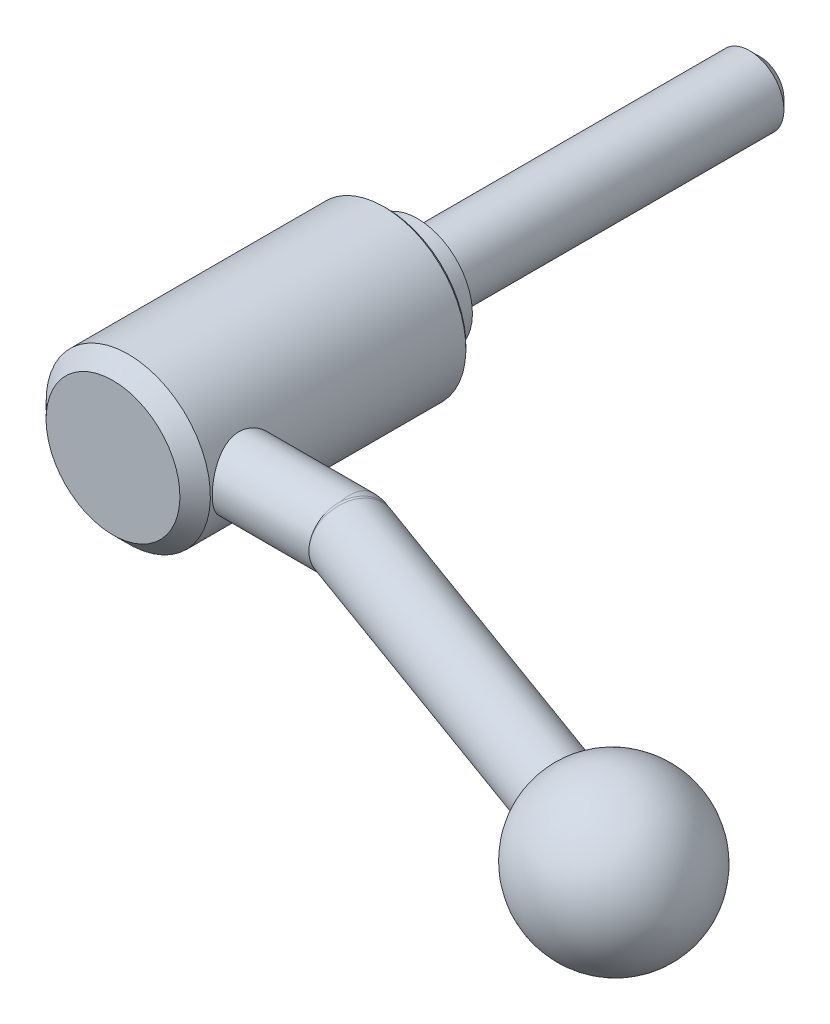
ISO-10303-21;
HEADER;
FILE_DESCRIPTION(('STEP AP214'),'2;1');
FILE_NAME('part.step','',(''),(''),'','','');
FILE_SCHEMA(('AUTOMOTIVE_DESIGN { 1 0 10303 214 1 1 1 1 }'));
ENDSEC;
DATA;
#1=APPLICATION_CONTEXT('core data for automotive mechanical design processes');
#2=APPLICATION_PROTOCOL_DEFINITION('international standard','automotive_design',2000,#1);
#3=PRODUCT_CONTEXT('',#1,'mechanical');
#4=PRODUCT('Part','Part','',(#3));
#5=PRODUCT_RELATED_PRODUCT_CATEGORY('part','',(#4));
#6=PRODUCT_DEFINITION_FORMATION('','',#4);
#7=PRODUCT_DEFINITION_CONTEXT('part definition',#1,'design');
#8=PRODUCT_DEFINITION('design','',#6,#7);
#9=PRODUCT_DEFINITION_SHAPE('','',#8);
#10=(LENGTH_UNIT() NAMED_UNIT(*) SI_UNIT(.MILLI.,.METRE.));
#11=(NAMED_UNIT(*) PLANE_ANGLE_UNIT() SI_UNIT($,.RADIAN.));
#12=(NAMED_UNIT(*) SI_UNIT($,.STERADIAN.) SOLID_ANGLE_UNIT());
#13=UNCERTAINTY_MEASURE_WITH_UNIT(LENGTH_MEASURE(1.E-05),#10,'distance_accuracy_value','');
#14=(GEOMETRIC_REPRESENTATION_CONTEXT(3) GLOBAL_UNCERTAINTY_ASSIGNED_CONTEXT((#13)) GLOBAL_UNIT_ASSIGNED_CONTEXT((#10,
#11,#12)) REPRESENTATION_CONTEXT('',''));
#15=CARTESIAN_POINT('',(0.,0.,0.));
#16=DIRECTION('',(0.,0.,1.));
#17=DIRECTION('',(1.,0.,0.));
#18=AXIS2_PLACEMENT_3D('',#15,#16,#17);
#19=CARTESIAN_POINT('',(0.,0.,0.));
#20=DIRECTION('',(0.,0.,-1.));
#21=DIRECTION('',(0.,1.,0.));
#22=AXIS2_PLACEMENT_3D('',#19,#20,#21);
#23=CYLINDRICAL_SURFACE('',#22,12.);
#24=CARTESIAN_POINT('',(0.,0.,4.95));
#25=DIRECTION('',(0.,0.,-1.));
#26=DIRECTION('',(0.,1.,0.));
#27=AXIS2_PLACEMENT_3D('',#24,#25,#26);
#28=CIRCLE('',#27,12.);
#29=CARTESIAN_POINT('',(0.,12.,4.95));
#30=VERTEX_POINT('',#29);
#31=EDGE_CURVE('E147',#30,#30,#28,.T.);
#32=ORIENTED_EDGE('',*,*,#31,.F.);
#33=EDGE_LOOP('',(#32));
#34=FACE_BOUND('',#33,.T.);
#35=CARTESIAN_POINT('',(10.9087121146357,5.,37.));
#36=CARTESIAN_POINT('',(10.9087130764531,4.99999907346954,37.1334013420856));
#37=CARTESIAN_POINT('',(10.9111675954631,4.99465346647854,37.266850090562));
#38=CARTESIAN_POINT('',(10.9209052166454,4.97332510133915,37.5327768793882));
#39=CARTESIAN_POINT('',(10.9281914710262,4.95733539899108,37.6652542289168));
#40=CARTESIAN_POINT('',(10.94736464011,4.91485001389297,37.928469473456));
#41=CARTESIAN_POINT('',(10.9592613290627,4.88833200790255,38.0592030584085));
#42=CARTESIAN_POINT('',(10.9872633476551,4.82506361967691,38.3177583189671));
#43=CARTESIAN_POINT('',(11.0033704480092,4.7883089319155,38.4455787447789));
#44=CARTESIAN_POINT('',(11.0391992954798,4.7051161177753,38.6968536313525));
#45=CARTESIAN_POINT('',(11.0589043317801,4.65872262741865,38.8203252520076));
#46=CARTESIAN_POINT('',(11.1013893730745,4.5565572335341,39.062794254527));
#47=CARTESIAN_POINT('',(11.1241705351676,4.5007817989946,39.1817899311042));
#48=CARTESIAN_POINT('',(11.1961478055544,4.3200790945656,39.5308988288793));
#49=CARTESIAN_POINT('',(11.2490254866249,4.18166963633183,39.7534507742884));
#50=CARTESIAN_POINT('',(11.3622340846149,3.86388960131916,40.185337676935));
#51=CARTESIAN_POINT('',(11.4228172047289,3.68264836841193,40.3932181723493));
#52=CARTESIAN_POINT('',(11.5425773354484,3.28805127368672,40.7768129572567));
#53=CARTESIAN_POINT('',(11.6017537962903,3.07468308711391,40.9525148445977));
#54=CARTESIAN_POINT('',(11.6861172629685,2.72939811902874,41.1918033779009));
#55=CARTESIAN_POINT('',(11.7140370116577,2.60726265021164,41.2688525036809));
#56=CARTESIAN_POINT('',(11.7670757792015,2.35633907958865,41.4123143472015));
#57=CARTESIAN_POINT('',(11.7921959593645,2.22755376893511,41.4787314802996));
#58=CARTESIAN_POINT('',(11.838917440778,1.96416180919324,41.6003389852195));
#59=CARTESIAN_POINT('',(11.8605184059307,1.82955460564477,41.6555282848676));
#60=CARTESIAN_POINT('',(11.8995529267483,1.55556138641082,41.7540939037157));
#61=CARTESIAN_POINT('',(11.9169885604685,1.41617779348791,41.7974761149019));
#62=CARTESIAN_POINT('',(11.9463943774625,1.14097065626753,41.8700493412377));
#63=CARTESIAN_POINT('',(11.9586002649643,1.00533485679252,41.8998574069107));
#64=CARTESIAN_POINT('',(11.978450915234,0.731783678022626,41.9481078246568));
#65=CARTESIAN_POINT('',(11.9860977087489,0.593869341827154,41.9665552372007));
#66=CARTESIAN_POINT('',(11.9966178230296,0.316820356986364,41.9918906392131));
#67=CARTESIAN_POINT('',(11.9994918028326,0.177685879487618,41.998780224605));
#68=CARTESIAN_POINT('',(12.0003846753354,-0.100685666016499,42.0009233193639));
#69=CARTESIAN_POINT('',(11.9984037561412,-0.239922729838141,41.9961772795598));
#70=CARTESIAN_POINT('',(11.9899136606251,-0.508875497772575,41.9757519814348));
#71=CARTESIAN_POINT('',(11.9836886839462,-0.638652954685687,41.9607587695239));
#72=CARTESIAN_POINT('',(11.9671679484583,-0.896425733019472,41.9207154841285));
#73=CARTESIAN_POINT('',(11.9568708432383,-1.02442045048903,41.8956620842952));
#74=CARTESIAN_POINT('',(11.9324642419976,-1.27768058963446,41.8357474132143));
#75=CARTESIAN_POINT('',(11.9183560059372,-1.40294689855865,41.8008893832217));
#76=CARTESIAN_POINT('',(11.8866740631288,-1.65000960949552,41.7216867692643));
#77=CARTESIAN_POINT('',(11.8690990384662,-1.77180467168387,41.6773385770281));
#78=CARTESIAN_POINT('',(11.8112061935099,-2.1344060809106,41.5291317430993));
#79=CARTESIAN_POINT('',(11.7660875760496,-2.36878813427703,41.4109765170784));
#80=CARTESIAN_POINT('',(11.6674248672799,-2.81488765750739,41.1406025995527));
#81=CARTESIAN_POINT('',(11.6138778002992,-3.02659707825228,40.9883718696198));
#82=CARTESIAN_POINT('',(11.4992708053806,-3.4373466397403,40.6416848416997));
#83=CARTESIAN_POINT('',(11.4379473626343,-3.6344418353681,40.4450085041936));
#84=CARTESIAN_POINT('',(11.317506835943,-3.9937495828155,40.0211105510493));
#85=CARTESIAN_POINT('',(11.2583906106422,-4.15594867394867,39.7938772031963));
#86=CARTESIAN_POINT('',(11.1754830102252,-4.37204843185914,39.4302315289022));
#87=CARTESIAN_POINT('',(11.1484199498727,-4.44042007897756,39.3029580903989));
#88=CARTESIAN_POINT('',(11.0975376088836,-4.5660982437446,39.0424564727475));
#89=CARTESIAN_POINT('',(11.0737170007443,-4.62340929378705,38.9092307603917));
#90=CARTESIAN_POINT('',(11.0301558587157,-4.72639308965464,38.6377673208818));
#91=CARTESIAN_POINT('',(11.010413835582,-4.77207008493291,38.4995314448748));
#92=CARTESIAN_POINT('',(10.9757324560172,-4.85130620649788,38.219039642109));
#93=CARTESIAN_POINT('',(10.9607926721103,-4.88486641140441,38.0767840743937));
#94=CARTESIAN_POINT('',(10.9370969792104,-4.93768074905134,37.7987576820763));
#95=CARTESIAN_POINT('',(10.9280027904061,-4.95772169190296,37.6631648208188));
#96=CARTESIAN_POINT('',(10.9148523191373,-4.9866073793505,37.3905520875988));
#97=CARTESIAN_POINT('',(10.9107956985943,-4.99545287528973,37.2535323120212));
#98=CARTESIAN_POINT('',(10.9078699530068,-5.00183821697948,36.9792139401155));
#99=CARTESIAN_POINT('',(10.9089993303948,-4.9993813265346,36.8419154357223));
#100=CARTESIAN_POINT('',(10.9163998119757,-4.98320111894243,36.5681288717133));
#101=CARTESIAN_POINT('',(10.9226707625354,-4.96947813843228,36.4316407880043));
#102=CARTESIAN_POINT('',(10.939564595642,-4.93217158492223,36.1692842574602));
#103=CARTESIAN_POINT('',(10.9498816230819,-4.90927900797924,36.0432974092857));
#104=CARTESIAN_POINT('',(10.9744912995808,-4.85401305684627,35.7938045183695));
#105=CARTESIAN_POINT('',(10.9887852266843,-4.82163663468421,35.6702992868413));
#106=CARTESIAN_POINT('',(11.0370194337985,-4.71071065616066,35.3047320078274));
#107=CARTESIAN_POINT('',(11.0763259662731,-4.6183356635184,35.0674195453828));
#108=CARTESIAN_POINT('',(11.1668340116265,-4.39509042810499,34.6014982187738));
#109=CARTESIAN_POINT('',(11.2184687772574,-4.26275559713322,34.3736835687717));
#110=CARTESIAN_POINT('',(11.3271978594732,-3.9648148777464,33.9423843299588));
#111=CARTESIAN_POINT('',(11.3842945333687,-3.79919458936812,33.7389103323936));
#112=CARTESIAN_POINT('',(11.5031524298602,-3.42333828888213,33.344771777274));
#113=CARTESIAN_POINT('',(11.5649149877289,-3.21056780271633,33.1564985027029));
#114=CARTESIAN_POINT('',(11.652539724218,-2.86918502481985,32.9026870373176));
#115=CARTESIAN_POINT('',(11.6809270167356,-2.75160882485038,32.8228101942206));
#116=CARTESIAN_POINT('',(11.7352796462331,-2.50969002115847,32.6731475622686));
#117=CARTESIAN_POINT('',(11.761246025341,-2.38535036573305,32.6033574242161));
#118=CARTESIAN_POINT('',(11.8101156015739,-2.13027929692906,32.4742500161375));
#119=CARTESIAN_POINT('',(11.8330091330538,-1.99952940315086,32.4149656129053));
#120=CARTESIAN_POINT('',(11.8749794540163,-1.73293321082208,32.3077113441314));
#121=CARTESIAN_POINT('',(11.8940578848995,-1.59708913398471,32.2597366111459));
#122=CARTESIAN_POINT('',(11.9278439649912,-1.32129951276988,32.1755883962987));
#123=CARTESIAN_POINT('',(11.9425527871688,-1.18135508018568,32.1394117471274));
#124=CARTESIAN_POINT('',(11.9671605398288,-0.89845467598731,32.0792595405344));
#125=CARTESIAN_POINT('',(11.9770598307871,-0.75549893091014,32.0552830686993));
#126=CARTESIAN_POINT('',(11.9912289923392,-0.477883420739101,32.021064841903));
#127=CARTESIAN_POINT('',(11.9958449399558,-0.343344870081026,32.0099778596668));
#128=CARTESIAN_POINT('',(12.0005316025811,-0.073683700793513,31.9987215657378));
#129=CARTESIAN_POINT('',(12.0006007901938,0.0614390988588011,31.9985559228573));
#130=CARTESIAN_POINT('',(11.9961887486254,0.331106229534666,32.0091516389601));
#131=CARTESIAN_POINT('',(11.9917099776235,0.465650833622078,32.0199070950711));
#132=CARTESIAN_POINT('',(11.9783256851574,0.733261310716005,32.0522225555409));
#133=CARTESIAN_POINT('',(11.9694185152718,0.866326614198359,32.0737865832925));
#134=CARTESIAN_POINT('',(11.9478093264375,1.12521434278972,32.1265303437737));
#135=CARTESIAN_POINT('',(11.9352551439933,1.25112522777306,32.1573367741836));
#136=CARTESIAN_POINT('',(11.9065633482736,1.49981842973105,32.2284909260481));
#137=CARTESIAN_POINT('',(11.8904244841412,1.62259963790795,32.2688419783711));
#138=CARTESIAN_POINT('',(11.8371898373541,1.98503132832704,32.403699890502));
#139=CARTESIAN_POINT('',(11.7952573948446,2.21898154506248,32.5120551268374));
#140=CARTESIAN_POINT('',(11.700229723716,2.67613896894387,32.7679713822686));
#141=CARTESIAN_POINT('',(11.6467156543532,2.8983828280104,32.9170829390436));
#142=CARTESIAN_POINT('',(11.5348651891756,3.31565850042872,33.248014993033));
#143=CARTESIAN_POINT('',(11.4765270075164,3.51068016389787,33.4298476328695));
#144=CARTESIAN_POINT('',(11.3565857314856,3.88182487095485,33.835823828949));
#145=CARTESIAN_POINT('',(11.2950305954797,4.05575892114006,34.0620045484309));
#146=CARTESIAN_POINT('',(11.2086213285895,4.28644220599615,34.4218577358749));
#147=CARTESIAN_POINT('',(11.1807840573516,4.35834922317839,34.5453544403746));
#148=CARTESIAN_POINT('',(11.1279493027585,4.49153302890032,34.7985115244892));
#149=CARTESIAN_POINT('',(11.1029505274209,4.55281466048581,34.9281690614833));
#150=CARTESIAN_POINT('',(11.0567342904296,4.66392927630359,35.1921877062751));
#151=CARTESIAN_POINT('',(11.0354990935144,4.7138162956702,35.3265229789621));
#152=CARTESIAN_POINT('',(10.9974167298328,4.80199267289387,35.599492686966));
#153=CARTESIAN_POINT('',(10.9805674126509,4.84028771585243,35.7381249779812));
#154=CARTESIAN_POINT('',(10.9519122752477,4.90477948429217,36.0182918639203));
#155=CARTESIAN_POINT('',(10.9400931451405,4.93100815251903,36.1598177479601));
#156=CARTESIAN_POINT('',(10.9219030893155,4.97116941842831,36.4448760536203));
#157=CARTESIAN_POINT('',(10.9155279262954,4.98511157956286,36.5884068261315));
#158=CARTESIAN_POINT('',(10.9109028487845,4.99521783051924,36.7768518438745));
#159=CARTESIAN_POINT('',(10.9100818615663,4.99701063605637,36.8214567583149));
#160=CARTESIAN_POINT('',(10.9089863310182,4.99940188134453,36.9107060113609));
#161=CARTESIAN_POINT('',(10.9087117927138,5.00000031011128,36.9553503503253));
#162=CARTESIAN_POINT('',(10.9087121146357,5.,37.));
#163=B_SPLINE_CURVE_WITH_KNOTS('',3,(#35,#36,#37,#38,#39,#40,#41,#42,#43,#44,#45,#46,#47,#48,
#49,#50,#51,#52,#53,#54,#55,#56,#57,#58,#59,#60,#61,#62,#63,#64,#65,#66,#67,#68,#69,#70,#71,#72,
#73,#74,#75,#76,#77,#78,#79,#80,#81,#82,#83,#84,#85,#86,#87,#88,#89,#90,#91,#92,#93,#94,#95,#96,
#97,#98,#99,#100,#101,#102,#103,#104,#105,#106,#107,#108,#109,#110,#111,#112,#113,#114,#115,
#116,#117,#118,#119,#120,#121,#122,#123,#124,#125,#126,#127,#128,#129,#130,#131,#132,#133,#134,
#135,#136,#137,#138,#139,#140,#141,#142,#143,#144,#145,#146,#147,#148,#149,#150,#151,#152,#153,
#154,#155,#156,#157,#158,#159,#160,#161,#162),.UNSPECIFIED.,.T.,.F.,(4,2,2,2,2,2,2,2,2,2,2,2,2,
2,2,2,2,2,2,2,2,2,2,2,2,2,2,2,2,2,2,2,2,2,2,2,2,2,2,2,2,2,2,2,2,2,2,2,2,2,2,2,2,2,2,2,2,2,2,2,2,
2,2,4),(0.,0.400157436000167,0.800576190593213,1.20184852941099,1.60328989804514,
2.00291210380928,2.40268505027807,3.20123019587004,4.04483609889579,4.88876646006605,
5.32954710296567,5.77014421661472,6.21078338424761,6.65120225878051,7.06888225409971,
7.48637606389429,7.90381222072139,8.32123220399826,8.71313663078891,9.10517074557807,
9.49707541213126,9.88912935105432,10.6843842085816,11.4799204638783,12.3315328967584,
13.1834732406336,13.6239634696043,14.064272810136,14.5044210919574,14.9445301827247,
15.3560893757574,15.7676209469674,16.1790336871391,16.5904341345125,16.9753736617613,
17.3604370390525,18.129966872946,18.9320860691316,19.7345530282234,20.6023475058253,
21.0367677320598,21.4710000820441,21.9065678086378,22.3419477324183,22.7772106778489,
23.2124409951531,23.6171514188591,24.0219977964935,24.4266254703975,24.8314038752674,
25.2216396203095,25.6120117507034,26.3921129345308,27.2074696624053,28.0231295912,
28.8942922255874,29.3306260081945,29.7667603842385,30.2007814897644,30.6345893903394,
31.067242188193,31.4995579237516,31.6334900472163,31.7674234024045),.UNSPECIFIED.);
#164=CARTESIAN_POINT('',(10.9087121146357,5.,37.));
#165=VERTEX_POINT('',#164);
#166=EDGE_CURVE('E77',#165,#165,#163,.T.);
#167=ORIENTED_EDGE('',*,*,#166,.F.);
#168=EDGE_LOOP('',(#167));
#169=FACE_BOUND('',#168,.T.);
#170=CARTESIAN_POINT('',(0.,0.,42.275));
#171=DIRECTION('',(0.,0.,-1.));
#172=DIRECTION('',(0.,1.,0.));
#173=AXIS2_PLACEMENT_3D('',#170,#171,#172);
#174=CIRCLE('',#173,12.);
#175=CARTESIAN_POINT('',(0.,12.,42.275));
#176=VERTEX_POINT('',#175);
#177=EDGE_CURVE('E149',#176,#176,#174,.T.);
#178=ORIENTED_EDGE('',*,*,#177,.T.);
#179=EDGE_LOOP('',(#178));
#180=FACE_BOUND('',#179,.T.);
#181=ADVANCED_FACE('F14',(#34,#169,#180),#23,.T.);
#182=CARTESIAN_POINT('',(0.,0.,44.5));
#183=DIRECTION('',(0.,0.,-1.));
#184=DIRECTION('',(0.,1.,0.));
#185=AXIS2_PLACEMENT_3D('',#182,#183,#184);
#186=PLANE('',#185);
#187=CARTESIAN_POINT('',(0.,0.,44.5));
#188=DIRECTION('',(0.,0.,-1.));
#189=DIRECTION('',(0.,1.,0.));
#190=AXIS2_PLACEMENT_3D('',#187,#188,#189);
#191=CIRCLE('',#190,9.775);
#192=CARTESIAN_POINT('',(0.,9.775,44.5));
#193=VERTEX_POINT('',#192);
#194=EDGE_CURVE('E85',#193,#193,#191,.T.);
#195=ORIENTED_EDGE('',*,*,#194,.F.);
#196=EDGE_LOOP('',(#195));
#197=FACE_BOUND('',#196,.T.);
#198=ADVANCED_FACE('F61',(#197),#186,.F.);
#199=CARTESIAN_POINT('',(0.,0.,44.5));
#200=DIRECTION('',(0.,0.,-1.));
#201=DIRECTION('',(0.,1.,0.));
#202=AXIS2_PLACEMENT_3D('',#199,#200,#201);
#203=CONICAL_SURFACE('',#202,9.775,0.785398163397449);
#204=ORIENTED_EDGE('',*,*,#177,.F.);
#205=EDGE_LOOP('',(#204));
#206=FACE_BOUND('',#205,.T.);
#207=ORIENTED_EDGE('',*,*,#194,.T.);
#208=EDGE_LOOP('',(#207));
#209=FACE_BOUND('',#208,.T.);
#210=ADVANCED_FACE('F67',(#206,#209),#203,.T.);
#211=CARTESIAN_POINT('',(0.,0.,4.95));
#212=DIRECTION('',(0.,0.,1.));
#213=DIRECTION('',(0.,-1.,0.));
#214=AXIS2_PLACEMENT_3D('',#211,#212,#213);
#215=CONICAL_SURFACE('',#214,12.,0.785398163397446);
#216=CARTESIAN_POINT('',(0.,0.,4.5));
#217=DIRECTION('',(0.,0.,-1.));
#218=DIRECTION('',(0.,1.,0.));
#219=AXIS2_PLACEMENT_3D('',#216,#217,#218);
#220=CIRCLE('',#219,11.55);
#221=CARTESIAN_POINT('',(0.,11.55,4.5));
#222=VERTEX_POINT('',#221);
#223=EDGE_CURVE('E142',#222,#222,#220,.T.);
#224=ORIENTED_EDGE('',*,*,#223,.F.);
#225=EDGE_LOOP('',(#224));
#226=FACE_BOUND('',#225,.T.);
#227=ORIENTED_EDGE('',*,*,#31,.T.);
#228=EDGE_LOOP('',(#227));
#229=FACE_BOUND('',#228,.T.);
#230=ADVANCED_FACE('F74',(#226,#229),#215,.T.);
#231=CARTESIAN_POINT('',(11.55,0.,4.5));
#232=DIRECTION('',(0.,0.,1.));
#233=DIRECTION('',(0.,-1.,0.));
#234=AXIS2_PLACEMENT_3D('',#231,#232,#233);
#235=PLANE('',#234);
#236=CARTESIAN_POINT('',(0.,0.,4.5));
#237=DIRECTION('',(0.,0.,-1.));
#238=DIRECTION('',(0.,1.,0.));
#239=AXIS2_PLACEMENT_3D('',#236,#237,#238);
#240=CIRCLE('',#239,8.);
#241=CARTESIAN_POINT('',(0.,8.,4.5));
#242=VERTEX_POINT('',#241);
#243=EDGE_CURVE('E140',#242,#242,#240,.T.);
#244=ORIENTED_EDGE('',*,*,#243,.F.);
#245=EDGE_LOOP('',(#244));
#246=FACE_BOUND('',#245,.T.);
#247=ORIENTED_EDGE('',*,*,#223,.T.);
#248=EDGE_LOOP('',(#247));
#249=FACE_BOUND('',#248,.T.);
#250=ADVANCED_FACE('F161',(#246,#249),#235,.F.);
#251=CARTESIAN_POINT('',(0.,0.,0.));
#252=DIRECTION('',(0.,0.,-1.));
#253=DIRECTION('',(0.,1.,0.));
#254=AXIS2_PLACEMENT_3D('',#251,#252,#253);
#255=CYLINDRICAL_SURFACE('',#254,8.);
#256=CARTESIAN_POINT('',(0.,0.,0.));
#257=DIRECTION('',(0.,0.,-1.));
#258=DIRECTION('',(0.,1.,0.));
#259=AXIS2_PLACEMENT_3D('',#256,#257,#258);
#260=CIRCLE('',#259,8.);
#261=CARTESIAN_POINT('',(0.,8.,0.));
#262=VERTEX_POINT('',#261);
#263=EDGE_CURVE('E138',#262,#262,#260,.T.);
#264=ORIENTED_EDGE('',*,*,#263,.F.);
#265=EDGE_LOOP('',(#264));
#266=FACE_BOUND('',#265,.T.);
#267=ORIENTED_EDGE('',*,*,#243,.T.);
#268=EDGE_LOOP('',(#267));
#269=FACE_BOUND('',#268,.T.);
#270=ADVANCED_FACE('F135',(#266,#269),#255,.T.);
#271=CARTESIAN_POINT('',(8.,0.,0.));
#272=DIRECTION('',(0.,0.,1.));
#273=DIRECTION('',(0.,-1.,0.));
#274=AXIS2_PLACEMENT_3D('',#271,#272,#273);
#275=PLANE('',#274);
#276=CARTESIAN_POINT('',(0.,0.,0.));
#277=DIRECTION('',(0.,0.,-1.));
#278=DIRECTION('',(0.,1.,0.));
#279=AXIS2_PLACEMENT_3D('',#276,#277,#278);
#280=CIRCLE('',#279,5.);
#281=CARTESIAN_POINT('',(0.,5.,0.));
#282=VERTEX_POINT('',#281);
#283=EDGE_CURVE('E126',#282,#282,#280,.T.);
#284=ORIENTED_EDGE('',*,*,#283,.F.);
#285=EDGE_LOOP('',(#284));
#286=FACE_BOUND('',#285,.T.);
#287=ORIENTED_EDGE('',*,*,#263,.T.);
#288=EDGE_LOOP('',(#287));
#289=FACE_BOUND('',#288,.T.);
#290=ADVANCED_FACE('F93',(#286,#289),#275,.F.);
#291=CARTESIAN_POINT('',(32.,0.,37.));
#292=DIRECTION('',(1.,0.,0.));
#293=DIRECTION('',(0.,1.,0.));
#294=AXIS2_PLACEMENT_3D('',#291,#292,#293);
#295=CYLINDRICAL_SURFACE('',#294,5.);
#296=CARTESIAN_POINT('',(27.0002,-4.83117434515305,38.2883145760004));
#297=CARTESIAN_POINT('',(26.9771151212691,-4.81425533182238,38.3517716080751));
#298=CARTESIAN_POINT('',(26.9549711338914,-4.79599919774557,38.4151983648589));
#299=CARTESIAN_POINT('',(26.9123130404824,-4.75682023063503,38.5417664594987));
#300=CARTESIAN_POINT('',(26.8917987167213,-4.73589775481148,38.6049078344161));
#301=CARTESIAN_POINT('',(26.8323357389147,-4.66915958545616,38.7935221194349));
#302=CARTESIAN_POINT('',(26.7954419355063,-4.61935429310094,38.9182563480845));
#303=CARTESIAN_POINT('',(26.7260075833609,-4.50939025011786,39.1641477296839));
#304=CARTESIAN_POINT('',(26.69346300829,-4.4492411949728,39.2853081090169));
#305=CARTESIAN_POINT('',(26.631969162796,-4.3188661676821,39.5230484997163));
#306=CARTESIAN_POINT('',(26.6030201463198,-4.2486394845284,39.6396281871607));
#307=CARTESIAN_POINT('',(26.5482810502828,-4.09859694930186,39.8670626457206));
#308=CARTESIAN_POINT('',(26.5224880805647,-4.01879000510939,39.9779226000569));
#309=CARTESIAN_POINT('',(26.4737060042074,-3.85000176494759,40.1931483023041));
#310=CARTESIAN_POINT('',(26.4507179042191,-3.76101719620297,40.2975117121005));
#311=CARTESIAN_POINT('',(26.4073462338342,-3.57452106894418,40.4988018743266));
#312=CARTESIAN_POINT('',(26.3869613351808,-3.47701390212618,40.595732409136));
#313=CARTESIAN_POINT('',(26.3486169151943,-3.27404367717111,40.7814771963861));
#314=CARTESIAN_POINT('',(26.330658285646,-3.16857771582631,40.8702884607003));
#315=CARTESIAN_POINT('',(26.2968878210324,-2.94931894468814,41.0399164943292));
#316=CARTESIAN_POINT('',(26.2810998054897,-2.83545204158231,41.1206422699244));
#317=CARTESIAN_POINT('',(26.2517972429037,-2.60111411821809,41.2724351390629));
#318=CARTESIAN_POINT('',(26.2382835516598,-2.48064063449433,41.3434985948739));
#319=CARTESIAN_POINT('',(26.2134747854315,-2.23400638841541,41.4753507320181));
#320=CARTESIAN_POINT('',(26.2021792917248,-2.10784670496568,41.5361413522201));
#321=CARTESIAN_POINT('',(26.1817528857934,-1.850678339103,41.6469996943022));
#322=CARTESIAN_POINT('',(26.1726227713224,-1.71966789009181,41.6970634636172));
#323=CARTESIAN_POINT('',(26.1565659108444,-1.45489437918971,41.7856658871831));
#324=CARTESIAN_POINT('',(26.1496212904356,-1.32116370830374,41.8242978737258));
#325=CARTESIAN_POINT('',(26.1378073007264,-1.05084556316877,41.8903082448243));
#326=CARTESIAN_POINT('',(26.1329387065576,-0.914257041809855,41.9176824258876));
#327=CARTESIAN_POINT('',(26.121432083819,-0.501829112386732,41.9825129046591));
#328=CARTESIAN_POINT('',(26.1178737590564,-0.223000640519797,42.0027862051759));
#329=CARTESIAN_POINT('',(26.1189625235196,0.332703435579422,41.9966121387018));
#330=CARTESIAN_POINT('',(26.1235681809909,0.609581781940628,41.9704006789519));
#331=CARTESIAN_POINT('',(26.1365918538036,1.01839236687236,41.8971560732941));
#332=CARTESIAN_POINT('',(26.1419571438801,1.15365429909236,41.8670594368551));
#333=CARTESIAN_POINT('',(26.1547482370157,1.42110904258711,41.7957866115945));
#334=CARTESIAN_POINT('',(26.162173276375,1.55330297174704,41.7546145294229));
#335=CARTESIAN_POINT('',(26.1791117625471,1.81374291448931,41.661488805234));
#336=CARTESIAN_POINT('',(26.1886259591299,1.94198749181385,41.6095312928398));
#337=CARTESIAN_POINT('',(26.2097731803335,2.19354456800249,41.4952682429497));
#338=CARTESIAN_POINT('',(26.2214054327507,2.3168588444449,41.4329664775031));
#339=CARTESIAN_POINT('',(26.2468425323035,2.55777038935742,41.2984703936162));
#340=CARTESIAN_POINT('',(26.2606478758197,2.67536634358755,41.2262738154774));
#341=CARTESIAN_POINT('',(26.2904898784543,2.90395912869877,41.0725891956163));
#342=CARTESIAN_POINT('',(26.3065257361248,3.01495830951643,40.991104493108));
#343=CARTESIAN_POINT('',(26.3410146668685,3.23022663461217,40.8189957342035));
#344=CARTESIAN_POINT('',(26.3594803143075,3.33445623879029,40.7283247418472));
#345=CARTESIAN_POINT('',(26.3988776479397,3.53478388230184,40.5389677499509));
#346=CARTESIAN_POINT('',(26.4198084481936,3.63088482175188,40.440284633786));
#347=CARTESIAN_POINT('',(26.4643216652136,3.81440211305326,40.2356199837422));
#348=CARTESIAN_POINT('',(26.4879053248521,3.90181435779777,40.1296350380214));
#349=CARTESIAN_POINT('',(26.5379464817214,4.06730764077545,39.9113164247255));
#350=CARTESIAN_POINT('',(26.564402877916,4.14539223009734,39.7989851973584));
#351=CARTESIAN_POINT('',(26.6190846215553,4.28799916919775,39.5748364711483));
#352=CARTESIAN_POINT('',(26.6471479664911,4.35301377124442,39.463292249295));
#353=CARTESIAN_POINT('',(26.7066083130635,4.47390595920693,39.2362277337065));
#354=CARTESIAN_POINT('',(26.7380049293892,4.52978459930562,39.1207079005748));
#355=CARTESIAN_POINT('',(26.8047544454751,4.63216753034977,38.8866145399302));
#356=CARTESIAN_POINT('',(26.8401091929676,4.67866741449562,38.7680396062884));
#357=CARTESIAN_POINT('',(26.915981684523,4.76212497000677,38.529146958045));
#358=CARTESIAN_POINT('',(26.9565014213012,4.79907894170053,38.4088285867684));
#359=CARTESIAN_POINT('',(27.000199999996,4.8311743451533,38.2883145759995));
#360=B_SPLINE_CURVE_WITH_KNOTS('',3,(#296,#297,#298,#299,#300,#301,#302,#303,#304,#305,#306,
#307,#308,#309,#310,#311,#312,#313,#314,#315,#316,#317,#318,#319,#320,#321,#322,#323,#324,#325,
#326,#327,#328,#329,#330,#331,#332,#333,#334,#335,#336,#337,#338,#339,#340,#341,#342,#343,#344,
#345,#346,#347,#348,#349,#350,#351,#352,#353,#354,#355,#356,#357,#358,#359),.UNSPECIFIED.,.F.,
.F.,(4,2,2,2,2,2,2,2,2,2,2,2,2,2,2,2,2,2,2,2,2,2,2,2,2,2,2,2,2,2,2,4),(0.,0.208793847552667,
0.417559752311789,0.834859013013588,1.25176923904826,1.66870889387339,2.08526383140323,
2.50196783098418,2.91845835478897,3.33510154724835,3.75600341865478,4.17706331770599,
4.5980436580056,5.01917885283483,5.43677439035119,5.85452571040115,6.68900674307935,
7.51926494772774,7.93487433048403,8.35032982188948,8.76593465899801,9.18138827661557,
9.59693693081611,10.0123366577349,10.4299775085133,10.8474687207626,11.2651563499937,
11.6826844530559,12.078641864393,12.4745535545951,12.870650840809,13.2669014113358),.UNSPECIFIED.);
#361=CARTESIAN_POINT('',(27.,-4.83102779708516,38.2888640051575));
#362=VERTEX_POINT('',#361);
#363=CARTESIAN_POINT('',(26.1183650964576,0.,42.));
#364=VERTEX_POINT('',#363);
#365=EDGE_CURVE('E29',#362,#364,#360,.T.);
#366=ORIENTED_EDGE('',*,*,#365,.T.);
#367=CARTESIAN_POINT('',(27.,4.83102779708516,38.2888640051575));
#368=VERTEX_POINT('',#367);
#369=EDGE_CURVE('E98',#364,#368,#360,.T.);
#370=ORIENTED_EDGE('',*,*,#369,.T.);
#371=CARTESIAN_POINT('',(27.,0.,37.));
#372=DIRECTION('',(1.,0.,0.));
#373=DIRECTION('',(0.,1.,0.));
#374=AXIS2_PLACEMENT_3D('',#371,#372,#373);
#375=CIRCLE('',#374,5.);
#376=EDGE_CURVE('E107',#362,#368,#375,.T.);
#377=ORIENTED_EDGE('',*,*,#376,.F.);
#378=EDGE_LOOP('',(#366,#370,#377));
#379=FACE_BOUND('',#378,.T.);
#380=ORIENTED_EDGE('',*,*,#166,.T.);
#381=EDGE_LOOP('',(#380));
#382=FACE_BOUND('',#381,.T.);
#383=ADVANCED_FACE('F87',(#379,#382),#295,.T.);
#384=CARTESIAN_POINT('',(27.,0.,37.));
#385=DIRECTION('',(1.,0.,0.));
#386=DIRECTION('',(0.,0.,1.));
#387=AXIS2_PLACEMENT_3D('',#384,#385,#386);
#388=SPHERICAL_SURFACE('',#387,5.);
#389=CARTESIAN_POINT('',(27.4142329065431,0.,37.1507684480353));
#390=DIRECTION('',(0.939692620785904,0.,0.342020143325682));
#391=DIRECTION('',(-0.342020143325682,0.,0.939692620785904));
#392=AXIS2_PLACEMENT_3D('',#389,#390,#391);
#393=CIRCLE('',#392,4.98053008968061);
#394=EDGE_CURVE('E36',#362,#368,#393,.T.);
#395=ORIENTED_EDGE('',*,*,#394,.F.);
#396=ORIENTED_EDGE('',*,*,#376,.T.);
#397=EDGE_LOOP('',(#395,#396));
#398=FACE_BOUND('',#397,.T.);
#399=ADVANCED_FACE('F92',(#398),#388,.T.);
#400=CARTESIAN_POINT('',(27.828465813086,0.,37.3015368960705));
#401=DIRECTION('',(0.939692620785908,0.,0.342020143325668));
#402=DIRECTION('',(-0.342020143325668,0.,0.939692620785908));
#403=AXIS2_PLACEMENT_3D('',#400,#401,#402);
#404=SPHERICAL_SURFACE('',#403,5.);
#405=ORIENTED_EDGE('',*,*,#365,.F.);
#406=ORIENTED_EDGE('',*,*,#394,.T.);
#407=ORIENTED_EDGE('',*,*,#369,.F.);
#408=CARTESIAN_POINT('',(27.8284658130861,0.,37.3015368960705));
#409=DIRECTION('',(0.939692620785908,0.,0.342020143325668));
#410=DIRECTION('',(-0.342020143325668,0.,0.939692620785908));
#411=AXIS2_PLACEMENT_3D('',#408,#409,#410);
#412=CIRCLE('',#411,5.);
#413=EDGE_CURVE('E105',#364,#364,#412,.T.);
#414=ORIENTED_EDGE('',*,*,#413,.F.);
#415=EDGE_LOOP('',(#405,#406,#407,#414));
#416=FACE_BOUND('',#415,.T.);
#417=ADVANCED_FACE('F109',(#416),#404,.T.);
#418=CARTESIAN_POINT('',(99.5041035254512,0.,63.3893355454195));
#419=DIRECTION('',(0.939692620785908,0.,0.342020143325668));
#420=DIRECTION('',(-0.342020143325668,0.,0.939692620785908));
#421=AXIS2_PLACEMENT_3D('',#418,#419,#420);
#422=CYLINDRICAL_SURFACE('',#421,5.);
#423=CARTESIAN_POINT('',(78.3773961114,0.,55.6998428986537));
#424=DIRECTION('',(0.939692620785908,0.,0.342020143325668));
#425=DIRECTION('',(-0.342020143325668,0.,0.939692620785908));
#426=AXIS2_PLACEMENT_3D('',#423,#424,#425);
#427=CIRCLE('',#426,5.);
#428=CARTESIAN_POINT('',(76.6672953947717,0.,60.3983060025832));
#429=VERTEX_POINT('',#428);
#430=EDGE_CURVE('E121',#429,#429,#427,.T.);
#431=ORIENTED_EDGE('',*,*,#430,.F.);
#432=EDGE_LOOP('',(#431));
#433=FACE_BOUND('',#432,.T.);
#434=ORIENTED_EDGE('',*,*,#413,.T.);
#435=EDGE_LOOP('',(#434));
#436=FACE_BOUND('',#435,.T.);
#437=ADVANCED_FACE('F56',(#433,#436),#422,.T.);
#438=CARTESIAN_POINT('',(76.6672953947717,0.,60.3983060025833));
#439=DIRECTION('',(0.939692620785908,0.,0.342020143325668));
#440=DIRECTION('',(-0.342020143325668,0.,0.939692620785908));
#441=AXIS2_PLACEMENT_3D('',#438,#439,#440);
#442=PLANE('',#441);
#443=CARTESIAN_POINT('',(78.3773961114,0.,55.6998428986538));
#444=DIRECTION('',(0.939692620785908,0.,0.342020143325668));
#445=DIRECTION('',(-0.342020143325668,0.,0.939692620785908));
#446=AXIS2_PLACEMENT_3D('',#443,#444,#445);
#447=CIRCLE('',#446,6.84016260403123);
#448=CARTESIAN_POINT('',(76.0379227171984,0.,62.1274932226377));
#449=VERTEX_POINT('',#448);
#450=EDGE_CURVE('E124',#449,#449,#447,.T.);
#451=ORIENTED_EDGE('',*,*,#450,.F.);
#452=EDGE_LOOP('',(#451));
#453=FACE_BOUND('',#452,.T.);
#454=ORIENTED_EDGE('',*,*,#430,.T.);
#455=EDGE_LOOP('',(#454));
#456=FACE_BOUND('',#455,.T.);
#457=ADVANCED_FACE('F45',(#453,#456),#442,.F.);
#458=CARTESIAN_POINT('',(88.,0.,58.5));
#459=DIRECTION('',(0.,0.999999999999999,0.));
#460=DIRECTION('',(-0.342020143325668,0.,0.939692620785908));
#461=AXIS2_PLACEMENT_3D('',#458,#459,#460);
#462=CIRCLE('',#461,12.5);
#463=TRIMMED_CURVE('',#462,(PARAMETER_VALUE(-1.51798478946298)),
(PARAMETER_VALUE(1.51798478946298)),.T.,.PARAMETER.);
#464=CARTESIAN_POINT('',(87.7743223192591,0.,59.1200443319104));
#465=DIRECTION('',(0.939692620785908,0.,0.342020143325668));
#466=AXIS1_PLACEMENT('',#464,#465);
#467=SURFACE_OF_REVOLUTION('',#463,#466);
#468=ORIENTED_EDGE('',*,*,#450,.T.);
#469=EDGE_LOOP('',(#468));
#470=FACE_BOUND('',#469,.T.);
#471=CARTESIAN_POINT('',(99.5041035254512,0.,63.3893355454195));
#472=VERTEX_POINT('',#471);
#473=VERTEX_LOOP('',#472);
#474=FACE_BOUND('',#473,.T.);
#475=ADVANCED_FACE('F42',(#470,#474),#467,.T.);
#476=CARTESIAN_POINT('',(0.,0.,14.));
#477=DIRECTION('',(0.,0.,-1.));
#478=DIRECTION('',(-1.,0.,0.));
#479=AXIS2_PLACEMENT_3D('',#476,#477,#478);
#480=CYLINDRICAL_SURFACE('',#479,5.);
#481=CARTESIAN_POINT('',(0.,0.,-48.5));
#482=DIRECTION('',(0.,0.,-1.));
#483=DIRECTION('',(-1.,0.,0.));
#484=AXIS2_PLACEMENT_3D('',#481,#482,#483);
#485=CIRCLE('',#484,5.);
#486=CARTESIAN_POINT('',(-5.,0.,-48.5));
#487=VERTEX_POINT('',#486);
#488=EDGE_CURVE('E9',#487,#487,#485,.F.);
#489=ORIENTED_EDGE('',*,*,#488,.T.);
#490=EDGE_LOOP('',(#489));
#491=FACE_BOUND('',#490,.T.);
#492=ORIENTED_EDGE('',*,*,#283,.T.);
#493=EDGE_LOOP('',(#492));
#494=FACE_BOUND('',#493,.T.);
#495=ADVANCED_FACE('F44',(#491,#494),#480,.T.);
#496=CARTESIAN_POINT('',(0.,0.,-50.));
#497=DIRECTION('',(0.,0.,-1.));
#498=DIRECTION('',(-1.,0.,0.));
#499=AXIS2_PLACEMENT_3D('',#496,#497,#498);
#500=PLANE('',#499);
#501=CARTESIAN_POINT('',(0.,0.,-50.));
#502=DIRECTION('',(0.,0.,-1.));
#503=DIRECTION('',(-1.,0.,0.));
#504=AXIS2_PLACEMENT_3D('',#501,#502,#503);
#505=CIRCLE('',#504,3.5);
#506=CARTESIAN_POINT('',(-3.5,0.,-50.));
#507=VERTEX_POINT('',#506);
#508=EDGE_CURVE('E22',#507,#507,#505,.T.);
#509=ORIENTED_EDGE('',*,*,#508,.T.);
#510=EDGE_LOOP('',(#509));
#511=FACE_BOUND('',#510,.T.);
#512=ADVANCED_FACE('F53',(#511),#500,.T.);
#513=CARTESIAN_POINT('',(0.,0.,-50.));
#514=DIRECTION('',(0.,0.,1.));
#515=DIRECTION('',(1.,0.,0.));
#516=AXIS2_PLACEMENT_3D('',#513,#514,#515);
#517=CONICAL_SURFACE('',#516,3.5,0.785398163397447);
#518=ORIENTED_EDGE('',*,*,#488,.F.);
#519=EDGE_LOOP('',(#518));
#520=FACE_BOUND('',#519,.T.);
#521=ORIENTED_EDGE('',*,*,#508,.F.);
#522=EDGE_LOOP('',(#521));
#523=FACE_BOUND('',#522,.T.);
#524=ADVANCED_FACE('F16',(#520,#523),#517,.T.);
#525=CLOSED_SHELL('',(#181,#198,#210,#230,#250,#270,#290,#383,#399,#417,#437,#457,#475,#495,
#512,#524));
#526=MANIFOLD_SOLID_BREP('B1',#525);
#527=ADVANCED_BREP_SHAPE_REPRESENTATION('',(#18,#526),#14);
#528=SHAPE_DEFINITION_REPRESENTATION(#9,#527);
ENDSEC;
END-ISO-10303-21;
